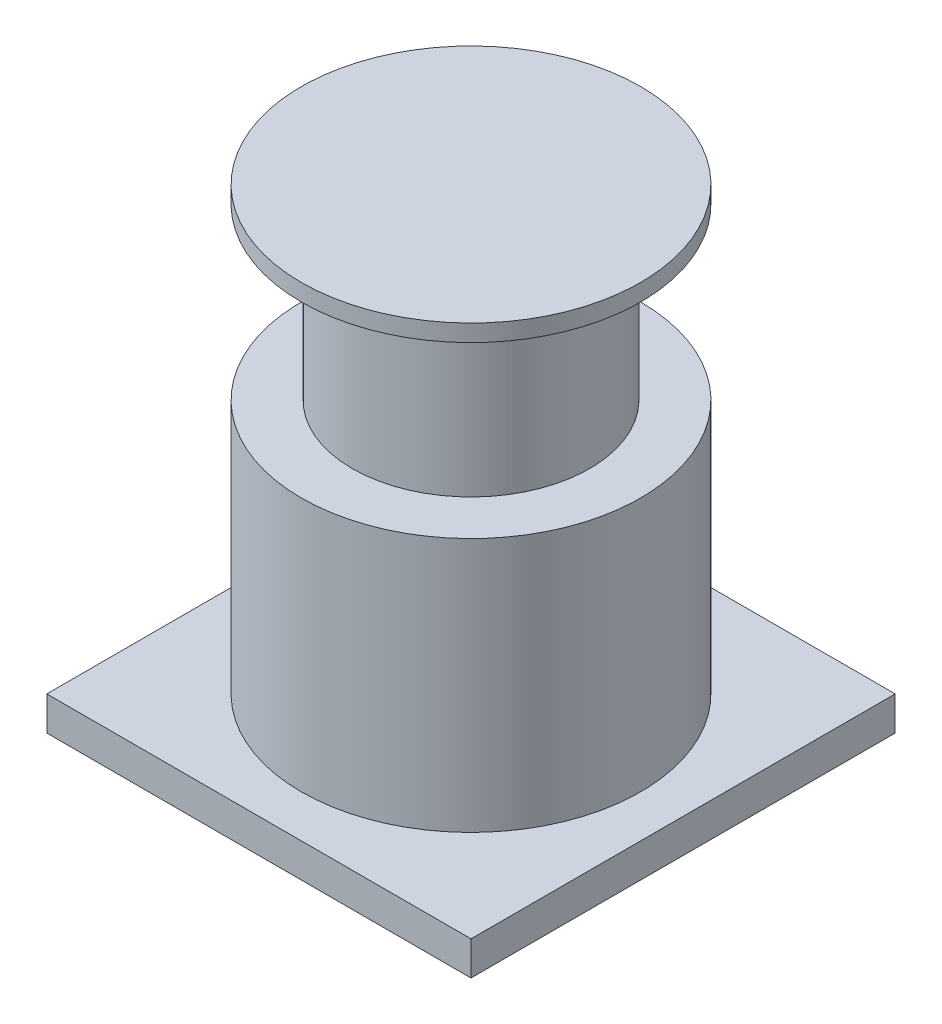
from build123d import *

# Parameters (mm, degrees)
SKETCH1_W           = 250
SKETCH1_H           = 250
BOSS_EXTRUDE1_DEPTH = 20
SKETCH2_R           = 100
BOSS_EXTRUDE2_DEPTH = 150
SKETCH3_R           = 70
BOSS_EXTRUDE3_DEPTH = 100
SKETCH4_R           = 100
BOSS_EXTRUDE4_DEPTH = 10


with BuildPart() as part:
    # Sketch1 → Boss-Extrude1 (new body)
    with BuildSketch(Plane(origin=(0, 0, 0), x_dir=(1, 0, 0), z_dir=(0, 1, 0))):
        with Locations((46.810699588, -38.16872428)):
            Rectangle(SKETCH1_W, SKETCH1_H)
    extrude(amount=BOSS_EXTRUDE1_DEPTH)

    # Sketch2 → Boss-Extrude2 (add)
    with BuildSketch(Plane(origin=(0, 20, 0), x_dir=(1, 0, 0), z_dir=(0, 1, 0))):
        with Locations(Location((46.810699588, -38.16872428, 0), (0, 0, 270))):
            Circle(SKETCH2_R)
    extrude(amount=BOSS_EXTRUDE2_DEPTH)

    # Sketch3 → Boss-Extrude3 (add)
    with BuildSketch(Plane(origin=(0, 170, 0), x_dir=(1, 0, 0), z_dir=(0, 1, 0))):
        with Locations(Location((46.810699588, -38.16872428, 0), (0, 0, 270))):
            Circle(SKETCH3_R)
    extrude(amount=BOSS_EXTRUDE3_DEPTH)

    # Sketch4 → Boss-Extrude4 (add)
    with BuildSketch(Plane(origin=(0, 270, 0), x_dir=(1, 0, 0), z_dir=(0, 1, 0))):
        with Locations(Location((46.810699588, -38.16872428, 0), (0, 0, 270))):
            Circle(SKETCH4_R)
    extrude(amount=BOSS_EXTRUDE4_DEPTH)


solid = part.part
